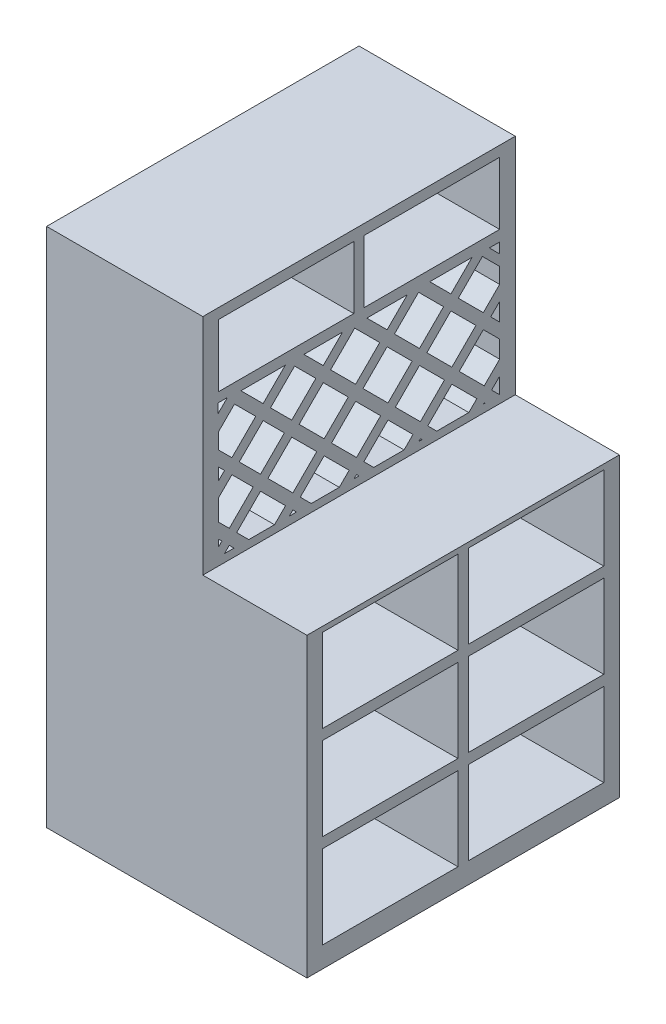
from build123d import *

# Parameters (mm, degrees)
SALIENTE_EXTRUIR1_DEPTH = 30
CROQUIS2_W              = 26
CROQUIS2_H              = 16
CORTAR_EXTRUIR1_DEPTH   = 116.758369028
CROQUIS3_W              = 26
CROQUIS3_H              = 12
CORTAR_EXTRUIR2_DEPTH   = 109.627804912
CORTAR_EXTRUIR4_DEPTH   = 109.627804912
CORTAR_EXTRUIR5_DEPTH   = 109.627804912
CORTAR_EXTRUIR6_DEPTH   = 109.627804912


with BuildPart() as part:
    # Croquis1 → Saliente-Extruir1 (new, symmetric)
    with BuildSketch(Plane.XY):
        Polygon((0, 0), (50, 0), (50, 57), (30, 57), (30, 100), (0, 100), align=None)
    extrude(amount=SALIENTE_EXTRUIR1_DEPTH, both=True)

    # Croquis2 → Cortar-Extruir1 (cut, through all)
    with BuildSketch(Plane(origin=(50, 0, 0), x_dir=(0, 0, -1), z_dir=(1, 0, 0))):
        with Locations((-14, 48)):
            Rectangle(CROQUIS2_W, CROQUIS2_H)
        with Locations((14, 48)):
            Rectangle(CROQUIS2_W, CROQUIS2_H)
        with Locations((-14, 30)):
            Rectangle(CROQUIS2_W, CROQUIS2_H)
        with Locations((14, 30)):
            Rectangle(CROQUIS2_W, CROQUIS2_H)
        with Locations((-14, 12)):
            Rectangle(CROQUIS2_W, CROQUIS2_H)
        with Locations((14, 12)):
            Rectangle(CROQUIS2_W, CROQUIS2_H)
    extrude(amount=-CORTAR_EXTRUIR1_DEPTH, mode=Mode.SUBTRACT)

    # Croquis3 → Cortar-Extruir2 (cut, through all)
    with BuildSketch(Plane(origin=(30, 0, 0), x_dir=(0, 0, -1), z_dir=(1, 0, 0))):
        with Locations((-14, 92)):
            Rectangle(CROQUIS3_W, CROQUIS3_H)
        with Locations((14, 92)):
            Rectangle(CROQUIS3_W, CROQUIS3_H)
    extrude(amount=-CORTAR_EXTRUIR2_DEPTH, mode=Mode.SUBTRACT)

    # Croquis4 → Cortar-Extruir4 (cut, through all)
    with BuildSketch(Plane(origin=(30, 0, 0), x_dir=(0, 0, -1), z_dir=(1, 0, 0))):
        Polygon((-0.005635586, 58.5), (-0.484079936, 58.97844435), (-0.962524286, 58.5), align=None)
        Polygon((-22.677208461, 84), (-18.418250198, 79.741041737), (-14.159291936, 84), align=None)
        Polygon((12.096371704, 58.48659694), (11.778369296, 58.804599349), (11.473769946, 58.5), align=None)
        Polygon((-10.588604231, 84), (-6.876072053, 80.287467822), (-3.163539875, 84), align=None)
        Polygon((24.171572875, 58.5), (24.040818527, 58.630754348), (23.910064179, 58.5), align=None)
        Polygon((1.5, 84), (5.386377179, 80.113622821), (9.272754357, 84), align=None)
        Polygon((27, 67.760177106), (23.866973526, 70.89320358), (19.236884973, 66.263115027), (24.040818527, 61.459181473), (27, 64.418362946), align=None)
        Polygon((13.588604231, 84), (17.64882641, 79.939777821), (21.709048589, 84), align=None)
        Polygon((27, 79.848781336), (23.693128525, 83.155652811), (19.063039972, 78.525564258), (23.866973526, 73.721630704), (27, 76.854657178), align=None)
        Polygon((-12.005635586, 58.5), (-12.702227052, 59.196591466), (-13.398818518, 58.5), align=None)
        Polygon((-27, 76.322791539), (-24.418250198, 73.741041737), (-19.832463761, 78.326828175), (-23.916126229, 82.410490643), (-27, 79.326616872), align=None)
        Polygon((-24.005635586, 58.5), (-24.920374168, 59.414738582), (-25.83511275, 58.5), align=None)
        Polygon((-27, 64.322791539), (-24.920374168, 62.243165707), (-20.33458773, 66.828952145), (-24.418250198, 70.912614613), (-27, 68.330864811), align=None)
        Polygon((-27, 60.163539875), (-26.33458773, 60.828952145), (-27, 61.494364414), align=None)
        Polygon((-14.563705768, 60.163539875), (-14.116440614, 60.610805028), (-18.920374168, 65.414738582), (-23.506160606, 60.828952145), (-21.177208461, 58.5), (-16.227245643, 58.5), align=None)
        Polygon((-2.127411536, 60.163539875), (-1.898293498, 60.392657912), (-6.702227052, 65.196591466), (-11.28801349, 60.610805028), (-9.177208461, 58.5), (-3.790951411, 58.5), align=None)
        Polygon((11.778369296, 61.633026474), (16.408457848, 66.263115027), (11.604524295, 71.067048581), (6.974435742, 66.436960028), align=None)
        Polygon((10.364155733, 60.218812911), (8.645342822, 58.5), (2.822791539, 58.5), (0.930133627, 60.392657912), (5.560222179, 65.022746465), align=None)
        Polygon((22.626604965, 60.044967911), (21.081637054, 58.5), (14.922173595, 58.489222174), (13.192582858, 60.218812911), (17.822671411, 64.848901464), align=None)
        Polygon((-23.004036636, 72.326828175), (-18.418250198, 76.912614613), (-14.33458773, 72.828952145), (-18.920374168, 68.243165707), align=None)
        Polygon((-17.506160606, 66.828952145), (-12.920374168, 71.414738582), (-8.116440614, 66.610805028), (-12.702227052, 62.025018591), align=None)
        Polygon((-11.506160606, 72.828952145), (-6.702227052, 68.025018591), (-2.072138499, 72.655107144), (-6.876072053, 77.459040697), align=None)
        Polygon((-8.290285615, 78.87325426), (-12.373948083, 82.956916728), (-17.004036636, 78.326828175), (-12.920374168, 74.243165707), align=None)
        Polygon((-5.46185849, 78.87325426), (-0.657924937, 74.069320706), (3.972163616, 78.699409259), (-0.831769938, 83.503342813), align=None)
        Polygon((-25.832463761, 72.326828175), (-27, 73.494364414), (-27, 71.159291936), align=None)
        Polygon((-5.28801349, 66.610805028), (-0.484079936, 61.806871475), (4.146008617, 66.436960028), (-0.657924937, 71.240893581), align=None)
        Polygon((0.756288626, 72.655107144), (5.386377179, 77.285195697), (10.190310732, 72.481262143), (5.560222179, 67.85117359), align=None)
        Polygon((6.800590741, 78.699409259), (11.604524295, 73.895475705), (16.234612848, 78.525564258), (11.430679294, 83.329497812), align=None)
        Polygon((17.822671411, 67.677328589), (22.452759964, 72.307417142), (17.64882641, 77.111350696), (13.018737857, 72.481262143), align=None)
        Polygon((25.281187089, 72.307417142), (27, 70.588604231), (27, 74.026230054), align=None)
        Polygon((25.455032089, 60.044967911), (27, 61.589935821), (27, 58.5), align=None)
    extrude(amount=-CORTAR_EXTRUIR4_DEPTH, mode=Mode.SUBTRACT)

    # Croquis5 → Cortar-Extruir5 (cut, through all)
    with BuildSketch(Plane(origin=(30, 0, 0), x_dir=(0, 0, -1), z_dir=(1, 0, 0))):
        Polygon((-27.085333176, 82.379183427), (-27.085333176, 84.183862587), (-25.280654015, 84.183862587), align=None)
    extrude(amount=-CORTAR_EXTRUIR5_DEPTH, mode=Mode.SUBTRACT)

    # Croquis6 → Cortar-Extruir6 (cut, through all)
    with BuildSketch(Plane(origin=(30, 0, 0), x_dir=(0, 0, -1), z_dir=(1, 0, 0))):
        Polygon((27.009208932, 83.908640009), (27.009208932, 81.911495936), (25.012064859, 83.908640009), align=None)
    extrude(amount=-CORTAR_EXTRUIR6_DEPTH, mode=Mode.SUBTRACT)


solid = part.part
